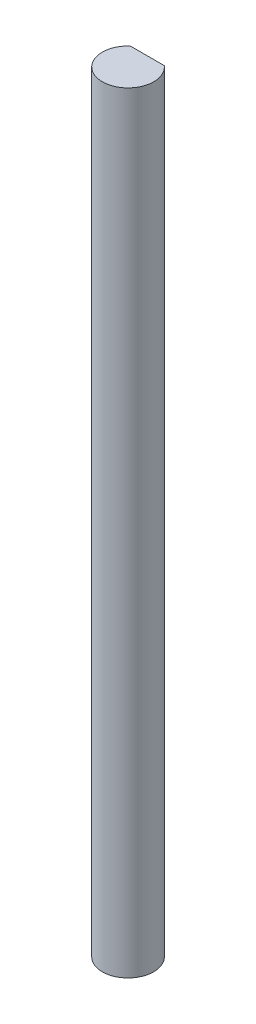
ISO-10303-21;
HEADER;
FILE_DESCRIPTION(('STEP AP214'),'2;1');
FILE_NAME('part.step','',(''),(''),'','','');
FILE_SCHEMA(('AUTOMOTIVE_DESIGN { 1 0 10303 214 1 1 1 1 }'));
ENDSEC;
DATA;
#1=APPLICATION_CONTEXT('core data for automotive mechanical design processes');
#2=APPLICATION_PROTOCOL_DEFINITION('international standard','automotive_design',2000,#1);
#3=PRODUCT_CONTEXT('',#1,'mechanical');
#4=PRODUCT('Part','Part','',(#3));
#5=PRODUCT_RELATED_PRODUCT_CATEGORY('part','',(#4));
#6=PRODUCT_DEFINITION_FORMATION('','',#4);
#7=PRODUCT_DEFINITION_CONTEXT('part definition',#1,'design');
#8=PRODUCT_DEFINITION('design','',#6,#7);
#9=PRODUCT_DEFINITION_SHAPE('','',#8);
#10=(LENGTH_UNIT() NAMED_UNIT(*) SI_UNIT(.MILLI.,.METRE.));
#11=(NAMED_UNIT(*) PLANE_ANGLE_UNIT() SI_UNIT($,.RADIAN.));
#12=(NAMED_UNIT(*) SI_UNIT($,.STERADIAN.) SOLID_ANGLE_UNIT());
#13=UNCERTAINTY_MEASURE_WITH_UNIT(LENGTH_MEASURE(1.E-05),#10,'distance_accuracy_value','');
#14=(GEOMETRIC_REPRESENTATION_CONTEXT(3) GLOBAL_UNCERTAINTY_ASSIGNED_CONTEXT((#13)) GLOBAL_UNIT_ASSIGNED_CONTEXT((#10,
#11,#12)) REPRESENTATION_CONTEXT('',''));
#15=CARTESIAN_POINT('',(0.,0.,0.));
#16=DIRECTION('',(0.,0.,1.));
#17=DIRECTION('',(1.,0.,0.));
#18=AXIS2_PLACEMENT_3D('',#15,#16,#17);
#19=CARTESIAN_POINT('',(0.,60.,0.));
#20=DIRECTION('',(0.,-1.,0.));
#21=DIRECTION('',(0.,0.,-1.));
#22=AXIS2_PLACEMENT_3D('',#19,#20,#21);
#23=CYLINDRICAL_SURFACE('',#22,2.);
#24=CARTESIAN_POINT('',(0.,60.,0.));
#25=DIRECTION('',(0.,1.,0.));
#26=DIRECTION('',(0.,0.,1.));
#27=AXIS2_PLACEMENT_3D('',#24,#25,#26);
#28=CIRCLE('',#27,2.);
#29=CARTESIAN_POINT('',(-1.3228756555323,60.,-1.5));
#30=VERTEX_POINT('',#29);
#31=CARTESIAN_POINT('',(1.3228756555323,60.,-1.5));
#32=VERTEX_POINT('',#31);
#33=EDGE_CURVE('E11',#30,#32,#28,.T.);
#34=ORIENTED_EDGE('',*,*,#33,.F.);
#35=DIRECTION('',(0.,1.,0.));
#36=VECTOR('',#35,1.);
#37=CARTESIAN_POINT('',(-1.3228756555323,48.,-1.5));
#38=LINE('',#37,#36);
#39=CARTESIAN_POINT('',(-1.3228756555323,48.,-1.5));
#40=VERTEX_POINT('',#39);
#41=EDGE_CURVE('E61',#40,#30,#38,.T.);
#42=ORIENTED_EDGE('',*,*,#41,.F.);
#43=CARTESIAN_POINT('',(0.,48.,0.));
#44=DIRECTION('',(0.,1.,0.));
#45=DIRECTION('',(0.,0.,1.));
#46=AXIS2_PLACEMENT_3D('',#43,#44,#45);
#47=CIRCLE('',#46,2.);
#48=CARTESIAN_POINT('',(1.3228756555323,48.,-1.5));
#49=VERTEX_POINT('',#48);
#50=EDGE_CURVE('E93',#49,#40,#47,.T.);
#51=ORIENTED_EDGE('',*,*,#50,.F.);
#52=DIRECTION('',(0.,1.,0.));
#53=VECTOR('',#52,1.);
#54=CARTESIAN_POINT('',(1.3228756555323,48.,-1.5));
#55=LINE('',#54,#53);
#56=EDGE_CURVE('E90',#49,#32,#55,.T.);
#57=ORIENTED_EDGE('',*,*,#56,.T.);
#58=EDGE_LOOP('',(#34,#42,#51,#57));
#59=FACE_BOUND('',#58,.T.);
#60=DIRECTION('',(0.,-1.,0.));
#61=VECTOR('',#60,1.);
#62=CARTESIAN_POINT('',(1.3228756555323,12.,-1.5));
#63=LINE('',#62,#61);
#64=CARTESIAN_POINT('',(1.3228756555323,12.,-1.5));
#65=VERTEX_POINT('',#64);
#66=CARTESIAN_POINT('',(1.3228756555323,0.,-1.5));
#67=VERTEX_POINT('',#66);
#68=EDGE_CURVE('E69',#65,#67,#63,.T.);
#69=ORIENTED_EDGE('',*,*,#68,.F.);
#70=CARTESIAN_POINT('',(0.,12.,0.));
#71=DIRECTION('',(0.,1.,0.));
#72=DIRECTION('',(0.,0.,1.));
#73=AXIS2_PLACEMENT_3D('',#70,#71,#72);
#74=CIRCLE('',#73,2.);
#75=CARTESIAN_POINT('',(-1.3228756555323,12.,-1.5));
#76=VERTEX_POINT('',#75);
#77=EDGE_CURVE('E109',#65,#76,#74,.T.);
#78=ORIENTED_EDGE('',*,*,#77,.T.);
#79=DIRECTION('',(0.,-1.,0.));
#80=VECTOR('',#79,1.);
#81=CARTESIAN_POINT('',(-1.3228756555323,12.,-1.5));
#82=LINE('',#81,#80);
#83=CARTESIAN_POINT('',(-1.3228756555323,0.,-1.5));
#84=VERTEX_POINT('',#83);
#85=EDGE_CURVE('E111',#76,#84,#82,.T.);
#86=ORIENTED_EDGE('',*,*,#85,.T.);
#87=CARTESIAN_POINT('',(0.,0.,0.));
#88=DIRECTION('',(0.,1.,0.));
#89=DIRECTION('',(0.,0.,1.));
#90=AXIS2_PLACEMENT_3D('',#87,#88,#89);
#91=CIRCLE('',#90,2.);
#92=EDGE_CURVE('E50',#84,#67,#91,.T.);
#93=ORIENTED_EDGE('',*,*,#92,.T.);
#94=EDGE_LOOP('',(#69,#78,#86,#93));
#95=FACE_BOUND('',#94,.T.);
#96=ADVANCED_FACE('F47',(#59,#95),#23,.T.);
#97=CARTESIAN_POINT('',(0.,0.,0.));
#98=DIRECTION('',(0.,1.,0.));
#99=DIRECTION('',(0.,0.,1.));
#100=AXIS2_PLACEMENT_3D('',#97,#98,#99);
#101=PLANE('',#100);
#102=DIRECTION('',(1.,0.,0.));
#103=VECTOR('',#102,1.);
#104=CARTESIAN_POINT('',(0.,0.,-1.5));
#105=LINE('',#104,#103);
#106=EDGE_CURVE('E101',#84,#67,#105,.T.);
#107=ORIENTED_EDGE('',*,*,#106,.T.);
#108=ORIENTED_EDGE('',*,*,#92,.F.);
#109=EDGE_LOOP('',(#107,#108));
#110=FACE_BOUND('',#109,.T.);
#111=ADVANCED_FACE('F118',(#110),#101,.F.);
#112=CARTESIAN_POINT('',(0.,60.,0.));
#113=DIRECTION('',(0.,1.,0.));
#114=DIRECTION('',(0.,0.,1.));
#115=AXIS2_PLACEMENT_3D('',#112,#113,#114);
#116=PLANE('',#115);
#117=DIRECTION('',(1.,0.,0.));
#118=VECTOR('',#117,1.);
#119=CARTESIAN_POINT('',(0.,60.,-1.5));
#120=LINE('',#119,#118);
#121=EDGE_CURVE('E94',#30,#32,#120,.T.);
#122=ORIENTED_EDGE('',*,*,#121,.F.);
#123=ORIENTED_EDGE('',*,*,#33,.T.);
#124=EDGE_LOOP('',(#122,#123));
#125=FACE_BOUND('',#124,.T.);
#126=ADVANCED_FACE('F131',(#125),#116,.T.);
#127=CARTESIAN_POINT('',(0.,12.,-1.5));
#128=DIRECTION('',(0.,0.,-1.));
#129=DIRECTION('',(-1.,0.,0.));
#130=AXIS2_PLACEMENT_3D('',#127,#128,#129);
#131=PLANE('',#130);
#132=ORIENTED_EDGE('',*,*,#106,.F.);
#133=ORIENTED_EDGE('',*,*,#85,.F.);
#134=DIRECTION('',(1.,0.,0.));
#135=VECTOR('',#134,1.);
#136=CARTESIAN_POINT('',(0.,12.,-1.5));
#137=LINE('',#136,#135);
#138=EDGE_CURVE('E103',#76,#65,#137,.T.);
#139=ORIENTED_EDGE('',*,*,#138,.T.);
#140=ORIENTED_EDGE('',*,*,#68,.T.);
#141=EDGE_LOOP('',(#132,#133,#139,#140));
#142=FACE_BOUND('',#141,.T.);
#143=ADVANCED_FACE('F119',(#142),#131,.T.);
#144=CARTESIAN_POINT('',(0.,12.,0.));
#145=DIRECTION('',(0.,1.,0.));
#146=DIRECTION('',(0.,0.,1.));
#147=AXIS2_PLACEMENT_3D('',#144,#145,#146);
#148=PLANE('',#147);
#149=ORIENTED_EDGE('',*,*,#138,.F.);
#150=ORIENTED_EDGE('',*,*,#77,.F.);
#151=EDGE_LOOP('',(#149,#150));
#152=FACE_BOUND('',#151,.T.);
#153=ADVANCED_FACE('F122',(#152),#148,.F.);
#154=CARTESIAN_POINT('',(0.,48.,-1.5));
#155=DIRECTION('',(0.,0.,1.));
#156=DIRECTION('',(1.,0.,0.));
#157=AXIS2_PLACEMENT_3D('',#154,#155,#156);
#158=PLANE('',#157);
#159=ORIENTED_EDGE('',*,*,#121,.T.);
#160=ORIENTED_EDGE('',*,*,#56,.F.);
#161=DIRECTION('',(1.,0.,0.));
#162=VECTOR('',#161,1.);
#163=CARTESIAN_POINT('',(0.,48.,-1.5));
#164=LINE('',#163,#162);
#165=EDGE_CURVE('E86',#40,#49,#164,.T.);
#166=ORIENTED_EDGE('',*,*,#165,.F.);
#167=ORIENTED_EDGE('',*,*,#41,.T.);
#168=EDGE_LOOP('',(#159,#160,#166,#167));
#169=FACE_BOUND('',#168,.T.);
#170=ADVANCED_FACE('F88',(#169),#158,.F.);
#171=CARTESIAN_POINT('',(0.,48.,0.));
#172=DIRECTION('',(0.,-1.,0.));
#173=DIRECTION('',(0.,0.,1.));
#174=AXIS2_PLACEMENT_3D('',#171,#172,#173);
#175=PLANE('',#174);
#176=ORIENTED_EDGE('',*,*,#165,.T.);
#177=ORIENTED_EDGE('',*,*,#50,.T.);
#178=EDGE_LOOP('',(#176,#177));
#179=FACE_BOUND('',#178,.T.);
#180=ADVANCED_FACE('F96',(#179),#175,.F.);
#181=CLOSED_SHELL('',(#96,#111,#126,#143,#153,#170,#180));
#182=MANIFOLD_SOLID_BREP('B2',#181);
#183=ADVANCED_BREP_SHAPE_REPRESENTATION('',(#18,#182),#14);
#184=SHAPE_DEFINITION_REPRESENTATION(#9,#183);
ENDSEC;
END-ISO-10303-21;
